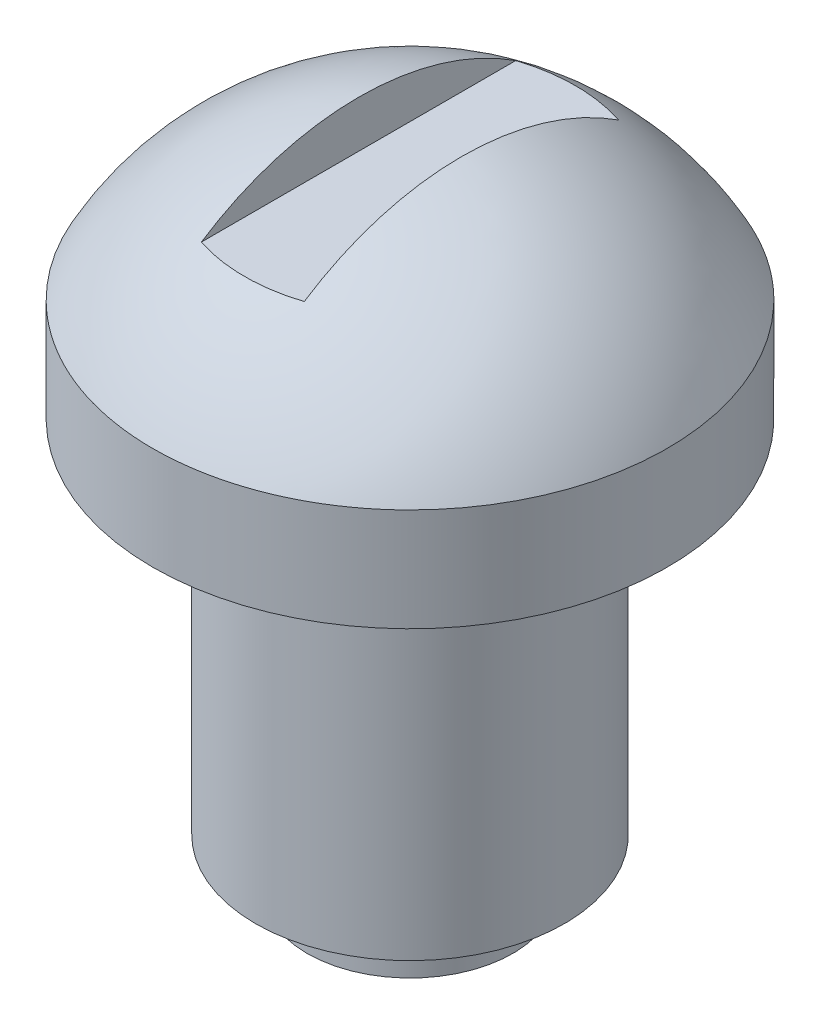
from build123d import *

# Parameters (mm, degrees)
DOME1_FACE_RADIUS  = 5
DOME1_HEIGHT       = 3
SKETCH3_W          = 2
SKETCH3_H          = 2
CUT_EXTRUDE1_DEPTH = 5


with BuildPart() as part:
    # Sketch1 → Revolve1 (revolve)
    with BuildSketch(Plane.XY, mode=Mode.PRIVATE) as revolve1_sk:
        Polygon((0, 0), (2, 0), (2, 1), (3, 1), (3, 8), (5, 8), (5, 10), (0, 10), align=None)
    revolve(revolve1_sk.sketch.rotate(Axis((0, 0, 0), (0, -1, 0)), 90), axis=Axis((0, 0, 0), (0, -1, 0)))

    # Dome1: a dome of height H over a round flat face of radius A is a cap of a sphere of radius (A * A + H * H) / (2 * H)
    dome1_r = (DOME1_FACE_RADIUS * DOME1_FACE_RADIUS + DOME1_HEIGHT * DOME1_HEIGHT) / (2 * DOME1_HEIGHT)
    dome1_base = Plane((0, 10, 0), z_dir=(0, 1, 0))
    with Locations(dome1_base.offset(DOME1_HEIGHT - dome1_r)):
        dome1_ball = Sphere(dome1_r, mode=Mode.PRIVATE)
    add(split(dome1_ball, bisect_by=dome1_base, keep=Keep.TOP, mode=Mode.PRIVATE))

    # Sketch3 → Cut-Extrude1 (cut, symmetric)
    with BuildSketch(Plane.XY):
        with Locations((0, 13)):
            Rectangle(SKETCH3_W, SKETCH3_H)
    extrude(amount=CUT_EXTRUDE1_DEPTH, both=True, mode=Mode.SUBTRACT)


solid = part.part
